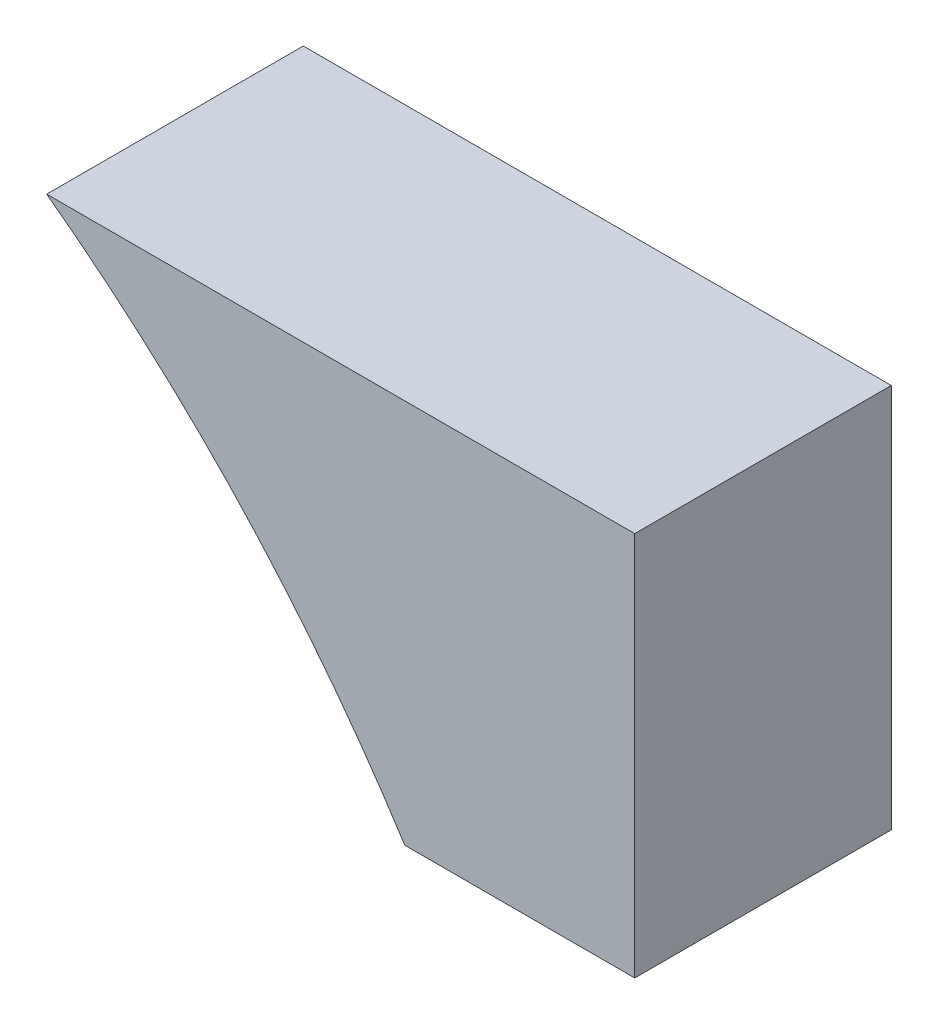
ISO-10303-21;
HEADER;
FILE_DESCRIPTION(('STEP AP214'),'2;1');
FILE_NAME('part.step','',(''),(''),'','','');
FILE_SCHEMA(('AUTOMOTIVE_DESIGN { 1 0 10303 214 1 1 1 1 }'));
ENDSEC;
DATA;
#1=APPLICATION_CONTEXT('core data for automotive mechanical design processes');
#2=APPLICATION_PROTOCOL_DEFINITION('international standard','automotive_design',2000,#1);
#3=PRODUCT_CONTEXT('',#1,'mechanical');
#4=PRODUCT('Part','Part','',(#3));
#5=PRODUCT_RELATED_PRODUCT_CATEGORY('part','',(#4));
#6=PRODUCT_DEFINITION_FORMATION('','',#4);
#7=PRODUCT_DEFINITION_CONTEXT('part definition',#1,'design');
#8=PRODUCT_DEFINITION('design','',#6,#7);
#9=PRODUCT_DEFINITION_SHAPE('','',#8);
#10=(LENGTH_UNIT() NAMED_UNIT(*) SI_UNIT(.MILLI.,.METRE.));
#11=(NAMED_UNIT(*) PLANE_ANGLE_UNIT() SI_UNIT($,.RADIAN.));
#12=(NAMED_UNIT(*) SI_UNIT($,.STERADIAN.) SOLID_ANGLE_UNIT());
#13=UNCERTAINTY_MEASURE_WITH_UNIT(LENGTH_MEASURE(1.E-05),#10,'distance_accuracy_value','');
#14=(GEOMETRIC_REPRESENTATION_CONTEXT(3) GLOBAL_UNCERTAINTY_ASSIGNED_CONTEXT((#13)) GLOBAL_UNIT_ASSIGNED_CONTEXT((#10,
#11,#12)) REPRESENTATION_CONTEXT('',''));
#15=CARTESIAN_POINT('',(0.,0.,0.));
#16=DIRECTION('',(0.,0.,1.));
#17=DIRECTION('',(1.,0.,0.));
#18=AXIS2_PLACEMENT_3D('',#15,#16,#17);
#19=CARTESIAN_POINT('',(0.,0.,20.));
#20=DIRECTION('',(0.,0.,-1.));
#21=DIRECTION('',(-1.,0.,0.));
#22=AXIS2_PLACEMENT_3D('',#19,#20,#21);
#23=CYLINDRICAL_SURFACE('',#22,112.);
#24=CARTESIAN_POINT('',(0.,0.,0.));
#25=DIRECTION('',(0.,0.,-1.));
#26=DIRECTION('',(1.,0.,0.));
#27=AXIS2_PLACEMENT_3D('',#24,#25,#26);
#28=CIRCLE('',#27,112.);
#29=CARTESIAN_POINT('',(66.6633332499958,90.,0.));
#30=VERTEX_POINT('',#29);
#31=CARTESIAN_POINT('',(94.5727233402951,60.,0.));
#32=VERTEX_POINT('',#31);
#33=EDGE_CURVE('E70',#30,#32,#28,.T.);
#34=ORIENTED_EDGE('',*,*,#33,.T.);
#35=DIRECTION('',(0.,0.,-1.));
#36=VECTOR('',#35,1.);
#37=CARTESIAN_POINT('',(94.5727233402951,60.,20.));
#38=LINE('',#37,#36);
#39=CARTESIAN_POINT('',(94.5727233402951,60.,20.));
#40=VERTEX_POINT('',#39);
#41=EDGE_CURVE('E11',#40,#32,#38,.T.);
#42=ORIENTED_EDGE('',*,*,#41,.F.);
#43=CARTESIAN_POINT('',(0.,0.,20.));
#44=DIRECTION('',(0.,0.,-1.));
#45=DIRECTION('',(1.,0.,0.));
#46=AXIS2_PLACEMENT_3D('',#43,#44,#45);
#47=CIRCLE('',#46,112.);
#48=CARTESIAN_POINT('',(66.6633332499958,90.,20.));
#49=VERTEX_POINT('',#48);
#50=EDGE_CURVE('E88',#49,#40,#47,.T.);
#51=ORIENTED_EDGE('',*,*,#50,.F.);
#52=DIRECTION('',(0.,0.,-1.));
#53=VECTOR('',#52,1.);
#54=CARTESIAN_POINT('',(66.6633332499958,90.,20.));
#55=LINE('',#54,#53);
#56=EDGE_CURVE('E82',#49,#30,#55,.T.);
#57=ORIENTED_EDGE('',*,*,#56,.T.);
#58=EDGE_LOOP('',(#34,#42,#51,#57));
#59=FACE_BOUND('',#58,.T.);
#60=ADVANCED_FACE('F26',(#59),#23,.F.);
#61=CARTESIAN_POINT('',(112.5,60.,20.));
#62=DIRECTION('',(0.,1.,0.));
#63=DIRECTION('',(0.,0.,1.));
#64=AXIS2_PLACEMENT_3D('',#61,#62,#63);
#65=PLANE('',#64);
#66=DIRECTION('',(1.,0.,0.));
#67=VECTOR('',#66,1.);
#68=CARTESIAN_POINT('',(112.5,60.,0.));
#69=LINE('',#68,#67);
#70=CARTESIAN_POINT('',(112.5,60.,0.));
#71=VERTEX_POINT('',#70);
#72=EDGE_CURVE('E66',#32,#71,#69,.T.);
#73=ORIENTED_EDGE('',*,*,#72,.T.);
#74=DIRECTION('',(0.,0.,-1.));
#75=VECTOR('',#74,1.);
#76=CARTESIAN_POINT('',(112.5,60.,20.));
#77=LINE('',#76,#75);
#78=CARTESIAN_POINT('',(112.5,60.,20.));
#79=VERTEX_POINT('',#78);
#80=EDGE_CURVE('E33',#79,#71,#77,.T.);
#81=ORIENTED_EDGE('',*,*,#80,.F.);
#82=DIRECTION('',(1.,0.,0.));
#83=VECTOR('',#82,1.);
#84=CARTESIAN_POINT('',(112.5,60.,20.));
#85=LINE('',#84,#83);
#86=EDGE_CURVE('E78',#40,#79,#85,.T.);
#87=ORIENTED_EDGE('',*,*,#86,.F.);
#88=ORIENTED_EDGE('',*,*,#41,.T.);
#89=EDGE_LOOP('',(#73,#81,#87,#88));
#90=FACE_BOUND('',#89,.T.);
#91=ADVANCED_FACE('F77',(#90),#65,.F.);
#92=CARTESIAN_POINT('',(112.5,90.,20.));
#93=DIRECTION('',(-1.,0.,0.));
#94=DIRECTION('',(0.,-1.,0.));
#95=AXIS2_PLACEMENT_3D('',#92,#93,#94);
#96=PLANE('',#95);
#97=DIRECTION('',(0.,1.,0.));
#98=VECTOR('',#97,1.);
#99=CARTESIAN_POINT('',(112.5,90.,0.));
#100=LINE('',#99,#98);
#101=CARTESIAN_POINT('',(112.5,90.,0.));
#102=VERTEX_POINT('',#101);
#103=EDGE_CURVE('E71',#71,#102,#100,.T.);
#104=ORIENTED_EDGE('',*,*,#103,.T.);
#105=DIRECTION('',(0.,0.,-1.));
#106=VECTOR('',#105,1.);
#107=CARTESIAN_POINT('',(112.5,90.,20.));
#108=LINE('',#107,#106);
#109=CARTESIAN_POINT('',(112.5,90.,20.));
#110=VERTEX_POINT('',#109);
#111=EDGE_CURVE('E94',#110,#102,#108,.T.);
#112=ORIENTED_EDGE('',*,*,#111,.F.);
#113=DIRECTION('',(0.,1.,0.));
#114=VECTOR('',#113,1.);
#115=CARTESIAN_POINT('',(112.5,90.,20.));
#116=LINE('',#115,#114);
#117=EDGE_CURVE('E45',#79,#110,#116,.T.);
#118=ORIENTED_EDGE('',*,*,#117,.F.);
#119=ORIENTED_EDGE('',*,*,#80,.T.);
#120=EDGE_LOOP('',(#104,#112,#118,#119));
#121=FACE_BOUND('',#120,.T.);
#122=ADVANCED_FACE('F97',(#121),#96,.F.);
#123=CARTESIAN_POINT('',(66.6633332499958,90.,20.));
#124=DIRECTION('',(0.,-1.,0.));
#125=DIRECTION('',(1.,0.,0.));
#126=AXIS2_PLACEMENT_3D('',#123,#124,#125);
#127=PLANE('',#126);
#128=DIRECTION('',(-1.,0.,0.));
#129=VECTOR('',#128,1.);
#130=CARTESIAN_POINT('',(66.6633332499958,90.,0.));
#131=LINE('',#130,#129);
#132=EDGE_CURVE('E86',#102,#30,#131,.T.);
#133=ORIENTED_EDGE('',*,*,#132,.T.);
#134=ORIENTED_EDGE('',*,*,#56,.F.);
#135=DIRECTION('',(-1.,0.,0.));
#136=VECTOR('',#135,1.);
#137=CARTESIAN_POINT('',(66.6633332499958,90.,20.));
#138=LINE('',#137,#136);
#139=EDGE_CURVE('E40',#110,#49,#138,.T.);
#140=ORIENTED_EDGE('',*,*,#139,.F.);
#141=ORIENTED_EDGE('',*,*,#111,.T.);
#142=EDGE_LOOP('',(#133,#134,#140,#141));
#143=FACE_BOUND('',#142,.T.);
#144=ADVANCED_FACE('F99',(#143),#127,.F.);
#145=CARTESIAN_POINT('',(0.,0.,20.));
#146=DIRECTION('',(0.,0.,1.));
#147=DIRECTION('',(1.,0.,0.));
#148=AXIS2_PLACEMENT_3D('',#145,#146,#147);
#149=PLANE('',#148);
#150=ORIENTED_EDGE('',*,*,#50,.T.);
#151=ORIENTED_EDGE('',*,*,#86,.T.);
#152=ORIENTED_EDGE('',*,*,#117,.T.);
#153=ORIENTED_EDGE('',*,*,#139,.T.);
#154=EDGE_LOOP('',(#150,#151,#152,#153));
#155=FACE_BOUND('',#154,.T.);
#156=ADVANCED_FACE('F100',(#155),#149,.T.);
#157=CARTESIAN_POINT('',(0.,0.,0.));
#158=DIRECTION('',(0.,0.,1.));
#159=DIRECTION('',(1.,0.,0.));
#160=AXIS2_PLACEMENT_3D('',#157,#158,#159);
#161=PLANE('',#160);
#162=ORIENTED_EDGE('',*,*,#33,.F.);
#163=ORIENTED_EDGE('',*,*,#132,.F.);
#164=ORIENTED_EDGE('',*,*,#103,.F.);
#165=ORIENTED_EDGE('',*,*,#72,.F.);
#166=EDGE_LOOP('',(#162,#163,#164,#165));
#167=FACE_BOUND('',#166,.T.);
#168=ADVANCED_FACE('F67',(#167),#161,.F.);
#169=CLOSED_SHELL('',(#60,#91,#122,#144,#156,#168));
#170=MANIFOLD_SOLID_BREP('B2',#169);
#171=ADVANCED_BREP_SHAPE_REPRESENTATION('',(#18,#170),#14);
#172=SHAPE_DEFINITION_REPRESENTATION(#9,#171);
ENDSEC;
END-ISO-10303-21;
